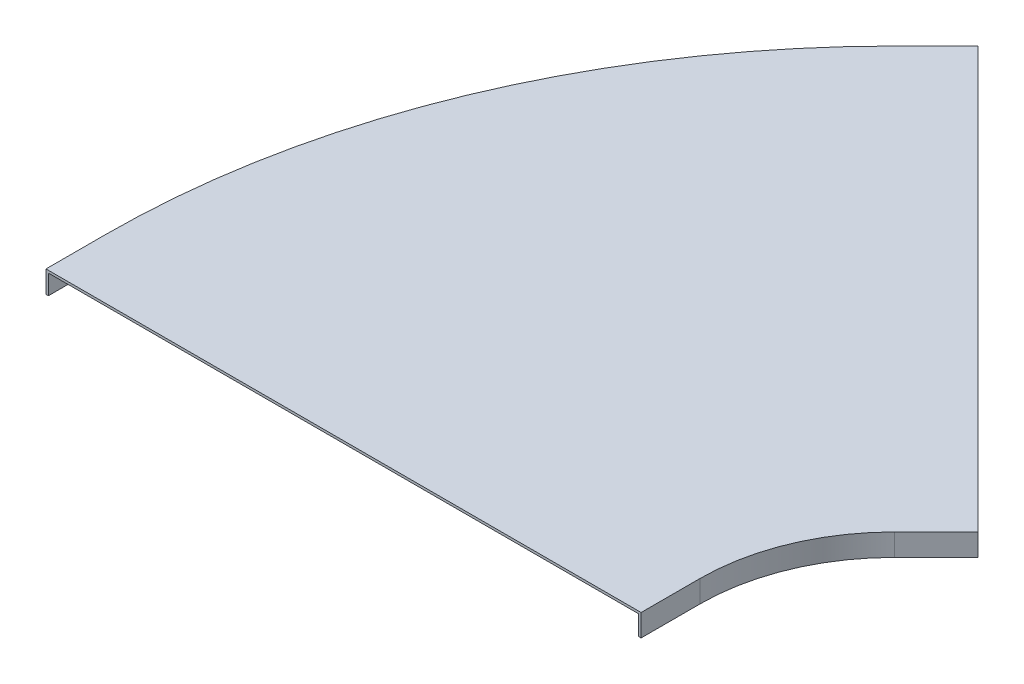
from build123d import *


with BuildPart() as part:
    # Sweep1: sweep along a path in Sketch2
    with BuildLine(Plane(origin=(0, 0, 0), x_dir=(1, 0, 0), z_dir=(0, 1, 0))) as sweep1_path:
        Line((0, 0), (0, 30))
        ThreePointArc((0, 30), (7.612046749, 68.268343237), (29.289321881, 100.710678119))
        Line((29.289321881, 100.710678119), (50.502525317, 121.923881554))
    # Sketch3 → Sweep1 (sweep)
    with BuildSketch(Plane.XY):
        Polygon((0, -10), (0, 0), (-300, 0), (-300, -10), (-301.214, -10), (-301.214, 1.214), (1.214, 1.214), (1.214, -10), align=None)
    sweep(path=sweep1_path.line)


solid = part.part
